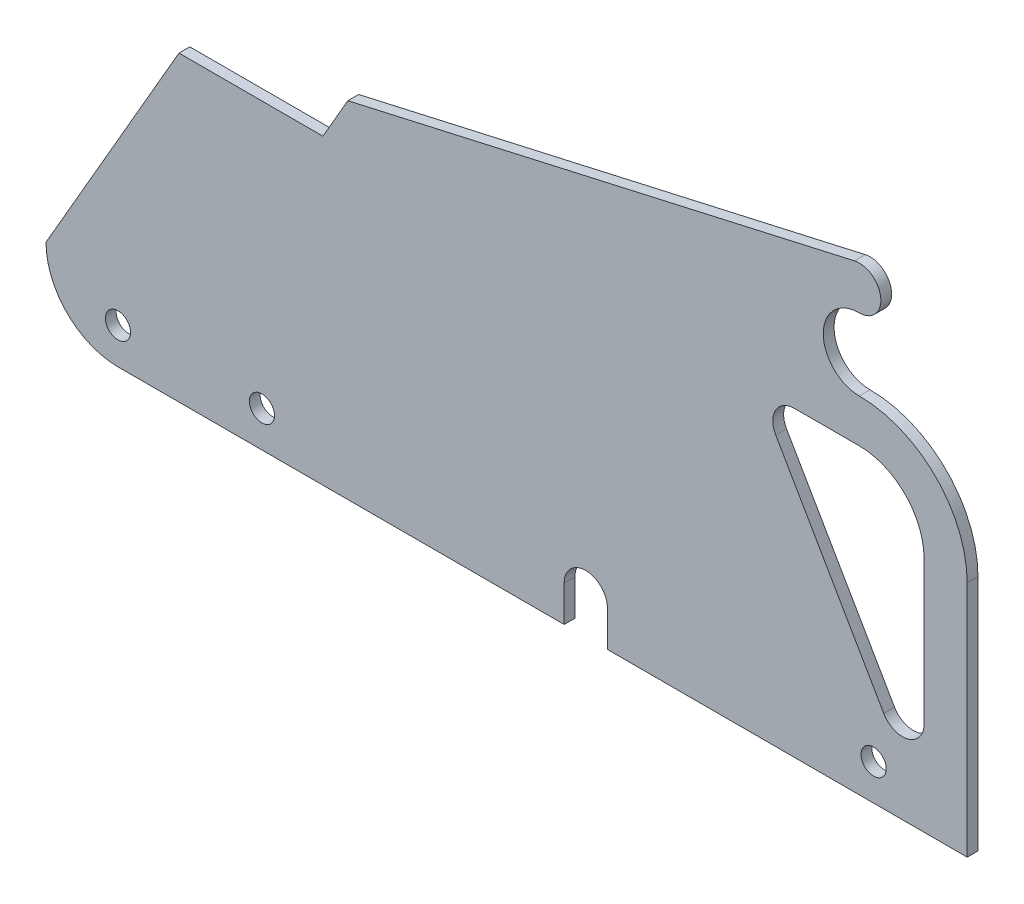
ISO-10303-21;
HEADER;
FILE_DESCRIPTION(('STEP AP214'),'2;1');
FILE_NAME('part.step','',(''),(''),'','','');
FILE_SCHEMA(('AUTOMOTIVE_DESIGN { 1 0 10303 214 1 1 1 1 }'));
ENDSEC;
DATA;
#1=APPLICATION_CONTEXT('core data for automotive mechanical design processes');
#2=APPLICATION_PROTOCOL_DEFINITION('international standard','automotive_design',2000,#1);
#3=PRODUCT_CONTEXT('',#1,'mechanical');
#4=PRODUCT('Part','Part','',(#3));
#5=PRODUCT_RELATED_PRODUCT_CATEGORY('part','',(#4));
#6=PRODUCT_DEFINITION_FORMATION('','',#4);
#7=PRODUCT_DEFINITION_CONTEXT('part definition',#1,'design');
#8=PRODUCT_DEFINITION('design','',#6,#7);
#9=PRODUCT_DEFINITION_SHAPE('','',#8);
#10=(LENGTH_UNIT() NAMED_UNIT(*) SI_UNIT(.MILLI.,.METRE.));
#11=(NAMED_UNIT(*) PLANE_ANGLE_UNIT() SI_UNIT($,.RADIAN.));
#12=(NAMED_UNIT(*) SI_UNIT($,.STERADIAN.) SOLID_ANGLE_UNIT());
#13=UNCERTAINTY_MEASURE_WITH_UNIT(LENGTH_MEASURE(1.E-05),#10,'distance_accuracy_value','');
#14=(GEOMETRIC_REPRESENTATION_CONTEXT(3) GLOBAL_UNCERTAINTY_ASSIGNED_CONTEXT((#13)) GLOBAL_UNIT_ASSIGNED_CONTEXT((#10,
#11,#12)) REPRESENTATION_CONTEXT('',''));
#15=CARTESIAN_POINT('',(0.,0.,0.));
#16=DIRECTION('',(0.,0.,1.));
#17=DIRECTION('',(1.,0.,0.));
#18=AXIS2_PLACEMENT_3D('',#15,#16,#17);
#19=CARTESIAN_POINT('',(-15.,33.,1.5));
#20=DIRECTION('',(0.,0.,1.));
#21=DIRECTION('',(1.,0.,0.));
#22=AXIS2_PLACEMENT_3D('',#19,#20,#21);
#23=PLANE('',#22);
#24=CARTESIAN_POINT('',(-98.,4.99999999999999,1.5));
#25=DIRECTION('',(0.,0.,1.));
#26=DIRECTION('',(1.,0.,0.));
#27=AXIS2_PLACEMENT_3D('',#24,#25,#26);
#28=CIRCLE('',#27,1.75);
#29=CARTESIAN_POINT('',(-96.25,4.99999999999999,1.5));
#30=VERTEX_POINT('',#29);
#31=EDGE_CURVE('E613',#30,#30,#28,.T.);
#32=ORIENTED_EDGE('',*,*,#31,.F.);
#33=EDGE_LOOP('',(#32));
#34=FACE_BOUND('',#33,.T.);
#35=DIRECTION('',(-1.,0.,0.));
#36=VECTOR('',#35,1.);
#37=CARTESIAN_POINT('',(-24.0111069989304,42.,1.5));
#38=LINE('',#37,#36);
#39=CARTESIAN_POINT('',(-15.,42.,1.5));
#40=VERTEX_POINT('',#39);
#41=CARTESIAN_POINT('',(-24.0111069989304,42.,1.5));
#42=VERTEX_POINT('',#41);
#43=EDGE_CURVE('E177',#40,#42,#38,.T.);
#44=ORIENTED_EDGE('',*,*,#43,.F.);
#45=CARTESIAN_POINT('',(-15.,33.,1.5));
#46=DIRECTION('',(0.,0.,1.));
#47=DIRECTION('',(1.,0.,0.));
#48=AXIS2_PLACEMENT_3D('',#45,#46,#47);
#49=CIRCLE('',#48,9.);
#50=CARTESIAN_POINT('',(-6.,33.,1.5));
#51=VERTEX_POINT('',#50);
#52=EDGE_CURVE('E169',#51,#40,#49,.T.);
#53=ORIENTED_EDGE('',*,*,#52,.F.);
#54=DIRECTION('',(0.,1.,0.));
#55=VECTOR('',#54,1.);
#56=CARTESIAN_POINT('',(-6.,33.,1.5));
#57=LINE('',#56,#55);
#58=CARTESIAN_POINT('',(-6.,13.,1.5));
#59=VERTEX_POINT('',#58);
#60=EDGE_CURVE('E200',#59,#51,#57,.T.);
#61=ORIENTED_EDGE('',*,*,#60,.F.);
#62=CARTESIAN_POINT('',(-9.,13.,1.5));
#63=DIRECTION('',(0.,0.,1.));
#64=DIRECTION('',(1.,0.,0.));
#65=AXIS2_PLACEMENT_3D('',#62,#63,#64);
#66=CIRCLE('',#65,3.);
#67=CARTESIAN_POINT('',(-11.5980762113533,11.5,1.5));
#68=VERTEX_POINT('',#67);
#69=EDGE_CURVE('E198',#68,#59,#66,.T.);
#70=ORIENTED_EDGE('',*,*,#69,.F.);
#71=DIRECTION('',(0.500000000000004,-0.866025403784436,0.));
#72=VECTOR('',#71,1.);
#73=CARTESIAN_POINT('',(-26.6091832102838,37.5,1.5));
#74=LINE('',#73,#72);
#75=CARTESIAN_POINT('',(-26.6091832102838,37.5,1.5));
#76=VERTEX_POINT('',#75);
#77=EDGE_CURVE('E193',#76,#68,#74,.T.);
#78=ORIENTED_EDGE('',*,*,#77,.F.);
#79=CARTESIAN_POINT('',(-24.0111069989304,39.,1.5));
#80=DIRECTION('',(0.,0.,1.));
#81=DIRECTION('',(1.,0.,0.));
#82=AXIS2_PLACEMENT_3D('',#79,#80,#81);
#83=CIRCLE('',#82,3.);
#84=EDGE_CURVE('E191',#42,#76,#83,.T.);
#85=ORIENTED_EDGE('',*,*,#84,.F.);
#86=EDGE_LOOP('',(#44,#53,#61,#70,#78,#85));
#87=FACE_BOUND('',#86,.T.);
#88=CARTESIAN_POINT('',(-15.,33.,1.5));
#89=DIRECTION('',(0.,0.,1.));
#90=DIRECTION('',(1.,0.,0.));
#91=AXIS2_PLACEMENT_3D('',#88,#89,#90);
#92=CIRCLE('',#91,15.);
#93=CARTESIAN_POINT('',(0.,33.,1.5));
#94=VERTEX_POINT('',#93);
#95=CARTESIAN_POINT('',(-15.,48.,1.5));
#96=VERTEX_POINT('',#95);
#97=EDGE_CURVE('E223',#94,#96,#92,.T.);
#98=ORIENTED_EDGE('',*,*,#97,.T.);
#99=CARTESIAN_POINT('',(-15.,53.,1.5));
#100=DIRECTION('',(0.,0.,-1.));
#101=DIRECTION('',(1.,0.,0.));
#102=AXIS2_PLACEMENT_3D('',#99,#100,#101);
#103=CIRCLE('',#102,5.);
#104=CARTESIAN_POINT('',(-15.,58.,1.5));
#105=VERTEX_POINT('',#104);
#106=EDGE_CURVE('E226',#96,#105,#103,.T.);
#107=ORIENTED_EDGE('',*,*,#106,.T.);
#108=CARTESIAN_POINT('',(-15.,61.,1.5));
#109=DIRECTION('',(0.,0.,1.));
#110=DIRECTION('',(1.,0.,0.));
#111=AXIS2_PLACEMENT_3D('',#108,#109,#110);
#112=CIRCLE('',#111,2.99999999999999);
#113=CARTESIAN_POINT('',(-15.661951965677,63.926058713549,1.5));
#114=VERTEX_POINT('',#113);
#115=EDGE_CURVE('E229',#105,#114,#112,.T.);
#116=ORIENTED_EDGE('',*,*,#115,.T.);
#117=DIRECTION('',(-0.975352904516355,-0.220650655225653,0.));
#118=VECTOR('',#117,1.);
#119=CARTESIAN_POINT('',(-15.661951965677,63.926058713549,1.5));
#120=LINE('',#119,#118);
#121=CARTESIAN_POINT('',(-86.0606897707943,48.,1.5));
#122=VERTEX_POINT('',#121);
#123=EDGE_CURVE('E231',#114,#122,#120,.T.);
#124=ORIENTED_EDGE('',*,*,#123,.T.);
#125=DIRECTION('',(-0.499999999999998,-0.866025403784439,0.));
#126=VECTOR('',#125,1.);
#127=CARTESIAN_POINT('',(-86.0606897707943,48.,1.5));
#128=LINE('',#127,#126);
#129=CARTESIAN_POINT('',(-89.5247913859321,42.,1.5));
#130=VERTEX_POINT('',#129);
#131=EDGE_CURVE('E233',#122,#130,#128,.T.);
#132=ORIENTED_EDGE('',*,*,#131,.T.);
#133=DIRECTION('',(-1.,0.,0.));
#134=VECTOR('',#133,1.);
#135=CARTESIAN_POINT('',(-89.5247913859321,42.,1.5));
#136=LINE('',#135,#134);
#137=CARTESIAN_POINT('',(-109.524791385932,42.,1.5));
#138=VERTEX_POINT('',#137);
#139=EDGE_CURVE('E235',#130,#138,#136,.T.);
#140=ORIENTED_EDGE('',*,*,#139,.T.);
#141=DIRECTION('',(-0.499999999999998,-0.86602540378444,0.));
#142=VECTOR('',#141,1.);
#143=CARTESIAN_POINT('',(-109.524791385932,42.,1.5));
#144=LINE('',#143,#142);
#145=CARTESIAN_POINT('',(-128.,10.,1.5));
#146=VERTEX_POINT('',#145);
#147=EDGE_CURVE('E237',#138,#146,#144,.T.);
#148=ORIENTED_EDGE('',*,*,#147,.T.);
#149=CARTESIAN_POINT('',(-118.,9.99999999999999,1.5));
#150=DIRECTION('',(0.,0.,1.));
#151=DIRECTION('',(1.,0.,0.));
#152=AXIS2_PLACEMENT_3D('',#149,#150,#151);
#153=CIRCLE('',#152,10.);
#154=CARTESIAN_POINT('',(-118.,0.,1.5));
#155=VERTEX_POINT('',#154);
#156=EDGE_CURVE('E239',#146,#155,#153,.T.);
#157=ORIENTED_EDGE('',*,*,#156,.T.);
#158=DIRECTION('',(1.,0.,0.));
#159=VECTOR('',#158,1.);
#160=CARTESIAN_POINT('',(-56.,0.,1.5));
#161=LINE('',#160,#159);
#162=CARTESIAN_POINT('',(-56.,0.,1.5));
#163=VERTEX_POINT('',#162);
#164=EDGE_CURVE('E241',#155,#163,#161,.T.);
#165=ORIENTED_EDGE('',*,*,#164,.T.);
#166=DIRECTION('',(0.,1.,0.));
#167=VECTOR('',#166,1.);
#168=CARTESIAN_POINT('',(-56.,4.99999999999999,1.5));
#169=LINE('',#168,#167);
#170=CARTESIAN_POINT('',(-56.,4.99999999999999,1.5));
#171=VERTEX_POINT('',#170);
#172=EDGE_CURVE('E243',#163,#171,#169,.T.);
#173=ORIENTED_EDGE('',*,*,#172,.T.);
#174=CARTESIAN_POINT('',(-53.,4.99999999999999,1.5));
#175=DIRECTION('',(0.,0.,-1.));
#176=DIRECTION('',(1.,0.,0.));
#177=AXIS2_PLACEMENT_3D('',#174,#175,#176);
#178=CIRCLE('',#177,3.);
#179=CARTESIAN_POINT('',(-50.,4.99999999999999,1.5));
#180=VERTEX_POINT('',#179);
#181=EDGE_CURVE('E245',#171,#180,#178,.T.);
#182=ORIENTED_EDGE('',*,*,#181,.T.);
#183=DIRECTION('',(0.,-1.,0.));
#184=VECTOR('',#183,1.);
#185=CARTESIAN_POINT('',(-50.,4.99999999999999,1.5));
#186=LINE('',#185,#184);
#187=CARTESIAN_POINT('',(-50.,0.,1.5));
#188=VERTEX_POINT('',#187);
#189=EDGE_CURVE('E247',#180,#188,#186,.T.);
#190=ORIENTED_EDGE('',*,*,#189,.T.);
#191=DIRECTION('',(1.,0.,0.));
#192=VECTOR('',#191,1.);
#193=CARTESIAN_POINT('',(0.,0.,1.5));
#194=LINE('',#193,#192);
#195=CARTESIAN_POINT('',(0.,0.,1.5));
#196=VERTEX_POINT('',#195);
#197=EDGE_CURVE('E249',#188,#196,#194,.T.);
#198=ORIENTED_EDGE('',*,*,#197,.T.);
#199=DIRECTION('',(0.,1.,0.));
#200=VECTOR('',#199,1.);
#201=CARTESIAN_POINT('',(0.,33.,1.5));
#202=LINE('',#201,#200);
#203=EDGE_CURVE('E251',#196,#94,#202,.T.);
#204=ORIENTED_EDGE('',*,*,#203,.T.);
#205=EDGE_LOOP('',(#98,#107,#116,#124,#132,#140,#148,#157,#165,#173,#182,#190,#198,#204));
#206=FACE_BOUND('',#205,.T.);
#207=CARTESIAN_POINT('',(-13.,4.99999999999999,1.5));
#208=DIRECTION('',(0.,0.,1.));
#209=DIRECTION('',(1.,0.,0.));
#210=AXIS2_PLACEMENT_3D('',#207,#208,#209);
#211=CIRCLE('',#210,1.75);
#212=CARTESIAN_POINT('',(-11.25,4.99999999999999,1.5));
#213=VERTEX_POINT('',#212);
#214=EDGE_CURVE('E203',#213,#213,#211,.T.);
#215=ORIENTED_EDGE('',*,*,#214,.F.);
#216=EDGE_LOOP('',(#215));
#217=FACE_BOUND('',#216,.T.);
#218=CARTESIAN_POINT('',(-118.,4.99999999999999,1.5));
#219=DIRECTION('',(0.,0.,1.));
#220=DIRECTION('',(1.,0.,0.));
#221=AXIS2_PLACEMENT_3D('',#218,#219,#220);
#222=CIRCLE('',#221,1.75);
#223=CARTESIAN_POINT('',(-116.25,4.99999999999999,1.5));
#224=VERTEX_POINT('',#223);
#225=EDGE_CURVE('E604',#224,#224,#222,.T.);
#226=ORIENTED_EDGE('',*,*,#225,.F.);
#227=EDGE_LOOP('',(#226));
#228=FACE_BOUND('',#227,.T.);
#229=ADVANCED_FACE('F32',(#34,#87,#206,#217,#228),#23,.T.);
#230=CARTESIAN_POINT('',(-15.,33.,0.));
#231=DIRECTION('',(0.,0.,1.));
#232=DIRECTION('',(1.,0.,0.));
#233=AXIS2_PLACEMENT_3D('',#230,#231,#232);
#234=PLANE('',#233);
#235=CARTESIAN_POINT('',(-98.,4.99999999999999,0.));
#236=DIRECTION('',(0.,0.,1.));
#237=DIRECTION('',(1.,0.,0.));
#238=AXIS2_PLACEMENT_3D('',#235,#236,#237);
#239=CIRCLE('',#238,1.75);
#240=CARTESIAN_POINT('',(-96.25,4.99999999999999,0.));
#241=VERTEX_POINT('',#240);
#242=EDGE_CURVE('E610',#241,#241,#239,.T.);
#243=ORIENTED_EDGE('',*,*,#242,.T.);
#244=EDGE_LOOP('',(#243));
#245=FACE_BOUND('',#244,.T.);
#246=CARTESIAN_POINT('',(-15.,33.,0.));
#247=DIRECTION('',(0.,0.,1.));
#248=DIRECTION('',(1.,0.,0.));
#249=AXIS2_PLACEMENT_3D('',#246,#247,#248);
#250=CIRCLE('',#249,9.);
#251=CARTESIAN_POINT('',(-6.,33.,0.));
#252=VERTEX_POINT('',#251);
#253=CARTESIAN_POINT('',(-15.,42.,0.));
#254=VERTEX_POINT('',#253);
#255=EDGE_CURVE('E55',#252,#254,#250,.T.);
#256=ORIENTED_EDGE('',*,*,#255,.T.);
#257=DIRECTION('',(-1.,0.,0.));
#258=VECTOR('',#257,1.);
#259=CARTESIAN_POINT('',(-24.0111069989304,42.,0.));
#260=LINE('',#259,#258);
#261=CARTESIAN_POINT('',(-24.0111069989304,42.,0.));
#262=VERTEX_POINT('',#261);
#263=EDGE_CURVE('E184',#254,#262,#260,.T.);
#264=ORIENTED_EDGE('',*,*,#263,.T.);
#265=CARTESIAN_POINT('',(-24.0111069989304,39.,0.));
#266=DIRECTION('',(0.,0.,1.));
#267=DIRECTION('',(1.,0.,0.));
#268=AXIS2_PLACEMENT_3D('',#265,#266,#267);
#269=CIRCLE('',#268,3.);
#270=CARTESIAN_POINT('',(-26.6091832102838,37.5,0.));
#271=VERTEX_POINT('',#270);
#272=EDGE_CURVE('E205',#262,#271,#269,.T.);
#273=ORIENTED_EDGE('',*,*,#272,.T.);
#274=DIRECTION('',(0.500000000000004,-0.866025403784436,0.));
#275=VECTOR('',#274,1.);
#276=CARTESIAN_POINT('',(-26.6091832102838,37.5,0.));
#277=LINE('',#276,#275);
#278=CARTESIAN_POINT('',(-11.5980762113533,11.5,0.));
#279=VERTEX_POINT('',#278);
#280=EDGE_CURVE('E208',#271,#279,#277,.T.);
#281=ORIENTED_EDGE('',*,*,#280,.T.);
#282=CARTESIAN_POINT('',(-9.,13.,0.));
#283=DIRECTION('',(0.,0.,1.));
#284=DIRECTION('',(1.,0.,0.));
#285=AXIS2_PLACEMENT_3D('',#282,#283,#284);
#286=CIRCLE('',#285,3.);
#287=CARTESIAN_POINT('',(-6.,13.,0.));
#288=VERTEX_POINT('',#287);
#289=EDGE_CURVE('E211',#279,#288,#286,.T.);
#290=ORIENTED_EDGE('',*,*,#289,.T.);
#291=DIRECTION('',(0.,1.,0.));
#292=VECTOR('',#291,1.);
#293=CARTESIAN_POINT('',(-6.,33.,0.));
#294=LINE('',#293,#292);
#295=EDGE_CURVE('E178',#288,#252,#294,.T.);
#296=ORIENTED_EDGE('',*,*,#295,.T.);
#297=EDGE_LOOP('',(#256,#264,#273,#281,#290,#296));
#298=FACE_BOUND('',#297,.T.);
#299=CARTESIAN_POINT('',(-15.,33.,0.));
#300=DIRECTION('',(0.,0.,1.));
#301=DIRECTION('',(1.,0.,0.));
#302=AXIS2_PLACEMENT_3D('',#299,#300,#301);
#303=CIRCLE('',#302,15.);
#304=CARTESIAN_POINT('',(0.,33.,0.));
#305=VERTEX_POINT('',#304);
#306=CARTESIAN_POINT('',(-15.,48.,0.));
#307=VERTEX_POINT('',#306);
#308=EDGE_CURVE('E185',#305,#307,#303,.T.);
#309=ORIENTED_EDGE('',*,*,#308,.F.);
#310=DIRECTION('',(0.,1.,0.));
#311=VECTOR('',#310,1.);
#312=CARTESIAN_POINT('',(0.,33.,0.));
#313=LINE('',#312,#311);
#314=CARTESIAN_POINT('',(0.,0.,0.));
#315=VERTEX_POINT('',#314);
#316=EDGE_CURVE('E227',#315,#305,#313,.T.);
#317=ORIENTED_EDGE('',*,*,#316,.F.);
#318=DIRECTION('',(1.,0.,0.));
#319=VECTOR('',#318,1.);
#320=CARTESIAN_POINT('',(0.,0.,0.));
#321=LINE('',#320,#319);
#322=CARTESIAN_POINT('',(-50.,0.,0.));
#323=VERTEX_POINT('',#322);
#324=EDGE_CURVE('E278',#323,#315,#321,.T.);
#325=ORIENTED_EDGE('',*,*,#324,.F.);
#326=DIRECTION('',(0.,-1.,0.));
#327=VECTOR('',#326,1.);
#328=CARTESIAN_POINT('',(-50.,4.99999999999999,0.));
#329=LINE('',#328,#327);
#330=CARTESIAN_POINT('',(-50.,4.99999999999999,0.));
#331=VERTEX_POINT('',#330);
#332=EDGE_CURVE('E276',#331,#323,#329,.T.);
#333=ORIENTED_EDGE('',*,*,#332,.F.);
#334=CARTESIAN_POINT('',(-53.,4.99999999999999,0.));
#335=DIRECTION('',(0.,0.,-1.));
#336=DIRECTION('',(1.,0.,0.));
#337=AXIS2_PLACEMENT_3D('',#334,#335,#336);
#338=CIRCLE('',#337,3.);
#339=CARTESIAN_POINT('',(-56.,4.99999999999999,0.));
#340=VERTEX_POINT('',#339);
#341=EDGE_CURVE('E274',#340,#331,#338,.T.);
#342=ORIENTED_EDGE('',*,*,#341,.F.);
#343=DIRECTION('',(0.,1.,0.));
#344=VECTOR('',#343,1.);
#345=CARTESIAN_POINT('',(-56.,4.99999999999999,0.));
#346=LINE('',#345,#344);
#347=CARTESIAN_POINT('',(-56.,0.,0.));
#348=VERTEX_POINT('',#347);
#349=EDGE_CURVE('E272',#348,#340,#346,.T.);
#350=ORIENTED_EDGE('',*,*,#349,.F.);
#351=DIRECTION('',(1.,0.,0.));
#352=VECTOR('',#351,1.);
#353=CARTESIAN_POINT('',(-56.,0.,0.));
#354=LINE('',#353,#352);
#355=CARTESIAN_POINT('',(-118.,0.,0.));
#356=VERTEX_POINT('',#355);
#357=EDGE_CURVE('E270',#356,#348,#354,.T.);
#358=ORIENTED_EDGE('',*,*,#357,.F.);
#359=CARTESIAN_POINT('',(-118.,9.99999999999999,0.));
#360=DIRECTION('',(0.,0.,1.));
#361=DIRECTION('',(1.,0.,0.));
#362=AXIS2_PLACEMENT_3D('',#359,#360,#361);
#363=CIRCLE('',#362,10.);
#364=CARTESIAN_POINT('',(-128.,10.,0.));
#365=VERTEX_POINT('',#364);
#366=EDGE_CURVE('E268',#365,#356,#363,.T.);
#367=ORIENTED_EDGE('',*,*,#366,.F.);
#368=DIRECTION('',(-0.499999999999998,-0.86602540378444,0.));
#369=VECTOR('',#368,1.);
#370=CARTESIAN_POINT('',(-109.524791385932,42.,0.));
#371=LINE('',#370,#369);
#372=CARTESIAN_POINT('',(-109.524791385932,42.,0.));
#373=VERTEX_POINT('',#372);
#374=EDGE_CURVE('E266',#373,#365,#371,.T.);
#375=ORIENTED_EDGE('',*,*,#374,.F.);
#376=DIRECTION('',(-1.,0.,0.));
#377=VECTOR('',#376,1.);
#378=CARTESIAN_POINT('',(-89.5247913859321,42.,0.));
#379=LINE('',#378,#377);
#380=CARTESIAN_POINT('',(-89.5247913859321,42.,0.));
#381=VERTEX_POINT('',#380);
#382=EDGE_CURVE('E264',#381,#373,#379,.T.);
#383=ORIENTED_EDGE('',*,*,#382,.F.);
#384=DIRECTION('',(-0.499999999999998,-0.866025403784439,0.));
#385=VECTOR('',#384,1.);
#386=CARTESIAN_POINT('',(-86.0606897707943,48.,0.));
#387=LINE('',#386,#385);
#388=CARTESIAN_POINT('',(-86.0606897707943,48.,0.));
#389=VERTEX_POINT('',#388);
#390=EDGE_CURVE('E262',#389,#381,#387,.T.);
#391=ORIENTED_EDGE('',*,*,#390,.F.);
#392=DIRECTION('',(-0.975352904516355,-0.220650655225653,0.));
#393=VECTOR('',#392,1.);
#394=CARTESIAN_POINT('',(-15.661951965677,63.926058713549,0.));
#395=LINE('',#394,#393);
#396=CARTESIAN_POINT('',(-15.661951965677,63.926058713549,0.));
#397=VERTEX_POINT('',#396);
#398=EDGE_CURVE('E260',#397,#389,#395,.T.);
#399=ORIENTED_EDGE('',*,*,#398,.F.);
#400=CARTESIAN_POINT('',(-15.,61.,0.));
#401=DIRECTION('',(0.,0.,1.));
#402=DIRECTION('',(1.,0.,0.));
#403=AXIS2_PLACEMENT_3D('',#400,#401,#402);
#404=CIRCLE('',#403,2.99999999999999);
#405=CARTESIAN_POINT('',(-15.,58.,0.));
#406=VERTEX_POINT('',#405);
#407=EDGE_CURVE('E258',#406,#397,#404,.T.);
#408=ORIENTED_EDGE('',*,*,#407,.F.);
#409=CARTESIAN_POINT('',(-15.,53.,0.));
#410=DIRECTION('',(0.,0.,-1.));
#411=DIRECTION('',(1.,0.,0.));
#412=AXIS2_PLACEMENT_3D('',#409,#410,#411);
#413=CIRCLE('',#412,5.);
#414=EDGE_CURVE('E256',#307,#406,#413,.T.);
#415=ORIENTED_EDGE('',*,*,#414,.F.);
#416=EDGE_LOOP('',(#309,#317,#325,#333,#342,#350,#358,#367,#375,#383,#391,#399,#408,#415));
#417=FACE_BOUND('',#416,.T.);
#418=CARTESIAN_POINT('',(-13.,4.99999999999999,0.));
#419=DIRECTION('',(0.,0.,1.));
#420=DIRECTION('',(1.,0.,0.));
#421=AXIS2_PLACEMENT_3D('',#418,#419,#420);
#422=CIRCLE('',#421,1.75);
#423=CARTESIAN_POINT('',(-11.25,4.99999999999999,0.));
#424=VERTEX_POINT('',#423);
#425=EDGE_CURVE('E616',#424,#424,#422,.T.);
#426=ORIENTED_EDGE('',*,*,#425,.T.);
#427=EDGE_LOOP('',(#426));
#428=FACE_BOUND('',#427,.T.);
#429=CARTESIAN_POINT('',(-118.,4.99999999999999,0.));
#430=DIRECTION('',(0.,0.,1.));
#431=DIRECTION('',(1.,0.,0.));
#432=AXIS2_PLACEMENT_3D('',#429,#430,#431);
#433=CIRCLE('',#432,1.75);
#434=CARTESIAN_POINT('',(-116.25,4.99999999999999,0.));
#435=VERTEX_POINT('',#434);
#436=EDGE_CURVE('E607',#435,#435,#433,.T.);
#437=ORIENTED_EDGE('',*,*,#436,.T.);
#438=EDGE_LOOP('',(#437));
#439=FACE_BOUND('',#438,.T.);
#440=ADVANCED_FACE('F326',(#245,#298,#417,#428,#439),#234,.F.);
#441=CARTESIAN_POINT('',(-15.,33.,1.5));
#442=DIRECTION('',(0.,0.,-1.));
#443=DIRECTION('',(-1.,0.,0.));
#444=AXIS2_PLACEMENT_3D('',#441,#442,#443);
#445=CYLINDRICAL_SURFACE('',#444,15.);
#446=ORIENTED_EDGE('',*,*,#308,.T.);
#447=DIRECTION('',(0.,0.,-1.));
#448=VECTOR('',#447,1.);
#449=CARTESIAN_POINT('',(-15.,48.,1.5));
#450=LINE('',#449,#448);
#451=EDGE_CURVE('E11',#96,#307,#450,.T.);
#452=ORIENTED_EDGE('',*,*,#451,.F.);
#453=ORIENTED_EDGE('',*,*,#97,.F.);
#454=DIRECTION('',(0.,0.,-1.));
#455=VECTOR('',#454,1.);
#456=CARTESIAN_POINT('',(0.,33.,1.5));
#457=LINE('',#456,#455);
#458=EDGE_CURVE('E253',#94,#305,#457,.T.);
#459=ORIENTED_EDGE('',*,*,#458,.T.);
#460=EDGE_LOOP('',(#446,#452,#453,#459));
#461=FACE_BOUND('',#460,.T.);
#462=ADVANCED_FACE('F34',(#461),#445,.T.);
#463=CARTESIAN_POINT('',(-15.,53.,1.5));
#464=DIRECTION('',(0.,0.,-1.));
#465=DIRECTION('',(-1.,0.,0.));
#466=AXIS2_PLACEMENT_3D('',#463,#464,#465);
#467=CYLINDRICAL_SURFACE('',#466,5.);
#468=ORIENTED_EDGE('',*,*,#414,.T.);
#469=DIRECTION('',(0.,0.,-1.));
#470=VECTOR('',#469,1.);
#471=CARTESIAN_POINT('',(-15.,58.,1.5));
#472=LINE('',#471,#470);
#473=EDGE_CURVE('E40',#105,#406,#472,.T.);
#474=ORIENTED_EDGE('',*,*,#473,.F.);
#475=ORIENTED_EDGE('',*,*,#106,.F.);
#476=ORIENTED_EDGE('',*,*,#451,.T.);
#477=EDGE_LOOP('',(#468,#474,#475,#476));
#478=FACE_BOUND('',#477,.T.);
#479=ADVANCED_FACE('F343',(#478),#467,.F.);
#480=CARTESIAN_POINT('',(-15.,61.,1.5));
#481=DIRECTION('',(0.,0.,-1.));
#482=DIRECTION('',(-1.,0.,0.));
#483=AXIS2_PLACEMENT_3D('',#480,#481,#482);
#484=CYLINDRICAL_SURFACE('',#483,2.99999999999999);
#485=ORIENTED_EDGE('',*,*,#407,.T.);
#486=DIRECTION('',(0.,0.,-1.));
#487=VECTOR('',#486,1.);
#488=CARTESIAN_POINT('',(-15.661951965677,63.926058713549,1.5));
#489=LINE('',#488,#487);
#490=EDGE_CURVE('E313',#114,#397,#489,.T.);
#491=ORIENTED_EDGE('',*,*,#490,.F.);
#492=ORIENTED_EDGE('',*,*,#115,.F.);
#493=ORIENTED_EDGE('',*,*,#473,.T.);
#494=EDGE_LOOP('',(#485,#491,#492,#493));
#495=FACE_BOUND('',#494,.T.);
#496=ADVANCED_FACE('F320',(#495),#484,.T.);
#497=CARTESIAN_POINT('',(-15.661951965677,63.926058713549,1.5));
#498=DIRECTION('',(0.220650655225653,-0.975352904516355,0.));
#499=DIRECTION('',(0.975352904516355,0.220650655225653,0.));
#500=AXIS2_PLACEMENT_3D('',#497,#498,#499);
#501=PLANE('',#500);
#502=ORIENTED_EDGE('',*,*,#398,.T.);
#503=DIRECTION('',(0.,0.,-1.));
#504=VECTOR('',#503,1.);
#505=CARTESIAN_POINT('',(-86.0606897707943,48.,1.5));
#506=LINE('',#505,#504);
#507=EDGE_CURVE('E310',#122,#389,#506,.T.);
#508=ORIENTED_EDGE('',*,*,#507,.F.);
#509=ORIENTED_EDGE('',*,*,#123,.F.);
#510=ORIENTED_EDGE('',*,*,#490,.T.);
#511=EDGE_LOOP('',(#502,#508,#509,#510));
#512=FACE_BOUND('',#511,.T.);
#513=ADVANCED_FACE('F332',(#512),#501,.F.);
#514=CARTESIAN_POINT('',(-86.0606897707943,48.,1.5));
#515=DIRECTION('',(0.86602540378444,-0.499999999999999,0.));
#516=DIRECTION('',(0.499999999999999,0.86602540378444,0.));
#517=AXIS2_PLACEMENT_3D('',#514,#515,#516);
#518=PLANE('',#517);
#519=ORIENTED_EDGE('',*,*,#390,.T.);
#520=DIRECTION('',(0.,0.,-1.));
#521=VECTOR('',#520,1.);
#522=CARTESIAN_POINT('',(-89.5247913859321,42.,1.5));
#523=LINE('',#522,#521);
#524=EDGE_CURVE('E307',#130,#381,#523,.T.);
#525=ORIENTED_EDGE('',*,*,#524,.F.);
#526=ORIENTED_EDGE('',*,*,#131,.F.);
#527=ORIENTED_EDGE('',*,*,#507,.T.);
#528=EDGE_LOOP('',(#519,#525,#526,#527));
#529=FACE_BOUND('',#528,.T.);
#530=ADVANCED_FACE('F336',(#529),#518,.F.);
#531=CARTESIAN_POINT('',(-89.5247913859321,42.,1.5));
#532=DIRECTION('',(0.,-1.,0.));
#533=DIRECTION('',(0.,0.,-1.));
#534=AXIS2_PLACEMENT_3D('',#531,#532,#533);
#535=PLANE('',#534);
#536=ORIENTED_EDGE('',*,*,#382,.T.);
#537=DIRECTION('',(0.,0.,-1.));
#538=VECTOR('',#537,1.);
#539=CARTESIAN_POINT('',(-109.524791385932,42.,1.5));
#540=LINE('',#539,#538);
#541=EDGE_CURVE('E304',#138,#373,#540,.T.);
#542=ORIENTED_EDGE('',*,*,#541,.F.);
#543=ORIENTED_EDGE('',*,*,#139,.F.);
#544=ORIENTED_EDGE('',*,*,#524,.T.);
#545=EDGE_LOOP('',(#536,#542,#543,#544));
#546=FACE_BOUND('',#545,.T.);
#547=ADVANCED_FACE('F386',(#546),#535,.F.);
#548=CARTESIAN_POINT('',(-109.524791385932,42.,1.5));
#549=DIRECTION('',(0.86602540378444,-0.499999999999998,0.));
#550=DIRECTION('',(0.499999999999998,0.86602540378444,0.));
#551=AXIS2_PLACEMENT_3D('',#548,#549,#550);
#552=PLANE('',#551);
#553=ORIENTED_EDGE('',*,*,#374,.T.);
#554=DIRECTION('',(0.,0.,-1.));
#555=VECTOR('',#554,1.);
#556=CARTESIAN_POINT('',(-128.,10.,1.5));
#557=LINE('',#556,#555);
#558=EDGE_CURVE('E301',#146,#365,#557,.T.);
#559=ORIENTED_EDGE('',*,*,#558,.F.);
#560=ORIENTED_EDGE('',*,*,#147,.F.);
#561=ORIENTED_EDGE('',*,*,#541,.T.);
#562=EDGE_LOOP('',(#553,#559,#560,#561));
#563=FACE_BOUND('',#562,.T.);
#564=ADVANCED_FACE('F384',(#563),#552,.F.);
#565=CARTESIAN_POINT('',(-118.,9.99999999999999,1.5));
#566=DIRECTION('',(0.,0.,-1.));
#567=DIRECTION('',(-1.,0.,0.));
#568=AXIS2_PLACEMENT_3D('',#565,#566,#567);
#569=CYLINDRICAL_SURFACE('',#568,10.);
#570=ORIENTED_EDGE('',*,*,#366,.T.);
#571=DIRECTION('',(0.,0.,-1.));
#572=VECTOR('',#571,1.);
#573=CARTESIAN_POINT('',(-118.,0.,1.5));
#574=LINE('',#573,#572);
#575=EDGE_CURVE('E298',#155,#356,#574,.T.);
#576=ORIENTED_EDGE('',*,*,#575,.F.);
#577=ORIENTED_EDGE('',*,*,#156,.F.);
#578=ORIENTED_EDGE('',*,*,#558,.T.);
#579=EDGE_LOOP('',(#570,#576,#577,#578));
#580=FACE_BOUND('',#579,.T.);
#581=ADVANCED_FACE('F379',(#580),#569,.T.);
#582=CARTESIAN_POINT('',(-56.,0.,1.5));
#583=DIRECTION('',(0.,1.,0.));
#584=DIRECTION('',(-1.,0.,0.));
#585=AXIS2_PLACEMENT_3D('',#582,#583,#584);
#586=PLANE('',#585);
#587=ORIENTED_EDGE('',*,*,#357,.T.);
#588=DIRECTION('',(0.,0.,-1.));
#589=VECTOR('',#588,1.);
#590=CARTESIAN_POINT('',(-56.,0.,1.5));
#591=LINE('',#590,#589);
#592=EDGE_CURVE('E295',#163,#348,#591,.T.);
#593=ORIENTED_EDGE('',*,*,#592,.F.);
#594=ORIENTED_EDGE('',*,*,#164,.F.);
#595=ORIENTED_EDGE('',*,*,#575,.T.);
#596=EDGE_LOOP('',(#587,#593,#594,#595));
#597=FACE_BOUND('',#596,.T.);
#598=ADVANCED_FACE('F374',(#597),#586,.F.);
#599=CARTESIAN_POINT('',(-56.,4.99999999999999,1.5));
#600=DIRECTION('',(-1.,0.,0.));
#601=DIRECTION('',(0.,0.,1.));
#602=AXIS2_PLACEMENT_3D('',#599,#600,#601);
#603=PLANE('',#602);
#604=ORIENTED_EDGE('',*,*,#349,.T.);
#605=DIRECTION('',(0.,0.,-1.));
#606=VECTOR('',#605,1.);
#607=CARTESIAN_POINT('',(-56.,4.99999999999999,1.5));
#608=LINE('',#607,#606);
#609=EDGE_CURVE('E292',#171,#340,#608,.T.);
#610=ORIENTED_EDGE('',*,*,#609,.F.);
#611=ORIENTED_EDGE('',*,*,#172,.F.);
#612=ORIENTED_EDGE('',*,*,#592,.T.);
#613=EDGE_LOOP('',(#604,#610,#611,#612));
#614=FACE_BOUND('',#613,.T.);
#615=ADVANCED_FACE('F370',(#614),#603,.F.);
#616=CARTESIAN_POINT('',(-53.,4.99999999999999,1.5));
#617=DIRECTION('',(0.,0.,-1.));
#618=DIRECTION('',(-1.,0.,0.));
#619=AXIS2_PLACEMENT_3D('',#616,#617,#618);
#620=CYLINDRICAL_SURFACE('',#619,3.);
#621=ORIENTED_EDGE('',*,*,#341,.T.);
#622=DIRECTION('',(0.,0.,-1.));
#623=VECTOR('',#622,1.);
#624=CARTESIAN_POINT('',(-50.,4.99999999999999,1.5));
#625=LINE('',#624,#623);
#626=EDGE_CURVE('E289',#180,#331,#625,.T.);
#627=ORIENTED_EDGE('',*,*,#626,.F.);
#628=ORIENTED_EDGE('',*,*,#181,.F.);
#629=ORIENTED_EDGE('',*,*,#609,.T.);
#630=EDGE_LOOP('',(#621,#627,#628,#629));
#631=FACE_BOUND('',#630,.T.);
#632=ADVANCED_FACE('F365',(#631),#620,.F.);
#633=CARTESIAN_POINT('',(-50.,4.99999999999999,1.5));
#634=DIRECTION('',(1.,0.,0.));
#635=DIRECTION('',(0.,0.,-1.));
#636=AXIS2_PLACEMENT_3D('',#633,#634,#635);
#637=PLANE('',#636);
#638=ORIENTED_EDGE('',*,*,#332,.T.);
#639=DIRECTION('',(0.,0.,-1.));
#640=VECTOR('',#639,1.);
#641=CARTESIAN_POINT('',(-50.,0.,1.5));
#642=LINE('',#641,#640);
#643=EDGE_CURVE('E286',#188,#323,#642,.T.);
#644=ORIENTED_EDGE('',*,*,#643,.F.);
#645=ORIENTED_EDGE('',*,*,#189,.F.);
#646=ORIENTED_EDGE('',*,*,#626,.T.);
#647=EDGE_LOOP('',(#638,#644,#645,#646));
#648=FACE_BOUND('',#647,.T.);
#649=ADVANCED_FACE('F359',(#648),#637,.F.);
#650=CARTESIAN_POINT('',(0.,0.,1.5));
#651=DIRECTION('',(0.,1.,0.));
#652=DIRECTION('',(-1.,0.,0.));
#653=AXIS2_PLACEMENT_3D('',#650,#651,#652);
#654=PLANE('',#653);
#655=ORIENTED_EDGE('',*,*,#324,.T.);
#656=DIRECTION('',(0.,0.,-1.));
#657=VECTOR('',#656,1.);
#658=CARTESIAN_POINT('',(0.,0.,1.5));
#659=LINE('',#658,#657);
#660=EDGE_CURVE('E283',#196,#315,#659,.T.);
#661=ORIENTED_EDGE('',*,*,#660,.F.);
#662=ORIENTED_EDGE('',*,*,#197,.F.);
#663=ORIENTED_EDGE('',*,*,#643,.T.);
#664=EDGE_LOOP('',(#655,#661,#662,#663));
#665=FACE_BOUND('',#664,.T.);
#666=ADVANCED_FACE('F355',(#665),#654,.F.);
#667=CARTESIAN_POINT('',(0.,33.,1.5));
#668=DIRECTION('',(-1.,0.,0.));
#669=DIRECTION('',(0.,-1.,0.));
#670=AXIS2_PLACEMENT_3D('',#667,#668,#669);
#671=PLANE('',#670);
#672=ORIENTED_EDGE('',*,*,#316,.T.);
#673=ORIENTED_EDGE('',*,*,#458,.F.);
#674=ORIENTED_EDGE('',*,*,#203,.F.);
#675=ORIENTED_EDGE('',*,*,#660,.T.);
#676=EDGE_LOOP('',(#672,#673,#674,#675));
#677=FACE_BOUND('',#676,.T.);
#678=ADVANCED_FACE('F350',(#677),#671,.F.);
#679=CARTESIAN_POINT('',(-15.,33.,1.5));
#680=DIRECTION('',(0.,0.,-1.));
#681=DIRECTION('',(-1.,0.,0.));
#682=AXIS2_PLACEMENT_3D('',#679,#680,#681);
#683=CYLINDRICAL_SURFACE('',#682,9.);
#684=ORIENTED_EDGE('',*,*,#255,.F.);
#685=DIRECTION('',(0.,0.,-1.));
#686=VECTOR('',#685,1.);
#687=CARTESIAN_POINT('',(-6.,33.,1.5));
#688=LINE('',#687,#686);
#689=EDGE_CURVE('E173',#51,#252,#688,.T.);
#690=ORIENTED_EDGE('',*,*,#689,.F.);
#691=ORIENTED_EDGE('',*,*,#52,.T.);
#692=DIRECTION('',(0.,0.,-1.));
#693=VECTOR('',#692,1.);
#694=CARTESIAN_POINT('',(-15.,42.,1.5));
#695=LINE('',#694,#693);
#696=EDGE_CURVE('E172',#40,#254,#695,.T.);
#697=ORIENTED_EDGE('',*,*,#696,.T.);
#698=EDGE_LOOP('',(#684,#690,#691,#697));
#699=FACE_BOUND('',#698,.T.);
#700=ADVANCED_FACE('F171',(#699),#683,.F.);
#701=CARTESIAN_POINT('',(-24.0111069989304,42.,1.5));
#702=DIRECTION('',(0.,-1.,0.));
#703=DIRECTION('',(0.,0.,-1.));
#704=AXIS2_PLACEMENT_3D('',#701,#702,#703);
#705=PLANE('',#704);
#706=ORIENTED_EDGE('',*,*,#263,.F.);
#707=ORIENTED_EDGE('',*,*,#696,.F.);
#708=ORIENTED_EDGE('',*,*,#43,.T.);
#709=DIRECTION('',(0.,0.,-1.));
#710=VECTOR('',#709,1.);
#711=CARTESIAN_POINT('',(-24.0111069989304,42.,1.5));
#712=LINE('',#711,#710);
#713=EDGE_CURVE('E186',#42,#262,#712,.T.);
#714=ORIENTED_EDGE('',*,*,#713,.T.);
#715=EDGE_LOOP('',(#706,#707,#708,#714));
#716=FACE_BOUND('',#715,.T.);
#717=ADVANCED_FACE('F181',(#716),#705,.T.);
#718=CARTESIAN_POINT('',(-24.0111069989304,39.,1.5));
#719=DIRECTION('',(0.,0.,-1.));
#720=DIRECTION('',(-1.,0.,0.));
#721=AXIS2_PLACEMENT_3D('',#718,#719,#720);
#722=CYLINDRICAL_SURFACE('',#721,3.);
#723=ORIENTED_EDGE('',*,*,#272,.F.);
#724=ORIENTED_EDGE('',*,*,#713,.F.);
#725=ORIENTED_EDGE('',*,*,#84,.T.);
#726=DIRECTION('',(0.,0.,-1.));
#727=VECTOR('',#726,1.);
#728=CARTESIAN_POINT('',(-26.6091832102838,37.5,1.5));
#729=LINE('',#728,#727);
#730=EDGE_CURVE('E220',#76,#271,#729,.T.);
#731=ORIENTED_EDGE('',*,*,#730,.T.);
#732=EDGE_LOOP('',(#723,#724,#725,#731));
#733=FACE_BOUND('',#732,.T.);
#734=ADVANCED_FACE('F459',(#733),#722,.F.);
#735=CARTESIAN_POINT('',(-26.6091832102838,37.5,1.5));
#736=DIRECTION('',(0.866025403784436,0.500000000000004,0.));
#737=DIRECTION('',(-0.500000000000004,0.866025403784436,0.));
#738=AXIS2_PLACEMENT_3D('',#735,#736,#737);
#739=PLANE('',#738);
#740=ORIENTED_EDGE('',*,*,#280,.F.);
#741=ORIENTED_EDGE('',*,*,#730,.F.);
#742=ORIENTED_EDGE('',*,*,#77,.T.);
#743=DIRECTION('',(0.,0.,-1.));
#744=VECTOR('',#743,1.);
#745=CARTESIAN_POINT('',(-11.5980762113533,11.5,1.5));
#746=LINE('',#745,#744);
#747=EDGE_CURVE('E218',#68,#279,#746,.T.);
#748=ORIENTED_EDGE('',*,*,#747,.T.);
#749=EDGE_LOOP('',(#740,#741,#742,#748));
#750=FACE_BOUND('',#749,.T.);
#751=ADVANCED_FACE('F465',(#750),#739,.T.);
#752=CARTESIAN_POINT('',(-9.,13.,1.5));
#753=DIRECTION('',(0.,0.,-1.));
#754=DIRECTION('',(-1.,0.,0.));
#755=AXIS2_PLACEMENT_3D('',#752,#753,#754);
#756=CYLINDRICAL_SURFACE('',#755,3.);
#757=ORIENTED_EDGE('',*,*,#289,.F.);
#758=ORIENTED_EDGE('',*,*,#747,.F.);
#759=ORIENTED_EDGE('',*,*,#69,.T.);
#760=DIRECTION('',(0.,0.,-1.));
#761=VECTOR('',#760,1.);
#762=CARTESIAN_POINT('',(-6.,13.,1.5));
#763=LINE('',#762,#761);
#764=EDGE_CURVE('E47',#59,#288,#763,.T.);
#765=ORIENTED_EDGE('',*,*,#764,.T.);
#766=EDGE_LOOP('',(#757,#758,#759,#765));
#767=FACE_BOUND('',#766,.T.);
#768=ADVANCED_FACE('F473',(#767),#756,.F.);
#769=CARTESIAN_POINT('',(-6.,33.,1.5));
#770=DIRECTION('',(-1.,0.,0.));
#771=DIRECTION('',(0.,-1.,0.));
#772=AXIS2_PLACEMENT_3D('',#769,#770,#771);
#773=PLANE('',#772);
#774=ORIENTED_EDGE('',*,*,#295,.F.);
#775=ORIENTED_EDGE('',*,*,#764,.F.);
#776=ORIENTED_EDGE('',*,*,#60,.T.);
#777=ORIENTED_EDGE('',*,*,#689,.T.);
#778=EDGE_LOOP('',(#774,#775,#776,#777));
#779=FACE_BOUND('',#778,.T.);
#780=ADVANCED_FACE('F481',(#779),#773,.T.);
#781=CARTESIAN_POINT('',(-13.,4.99999999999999,1.5));
#782=DIRECTION('',(0.,0.,-1.));
#783=DIRECTION('',(-1.,0.,0.));
#784=AXIS2_PLACEMENT_3D('',#781,#782,#783);
#785=CYLINDRICAL_SURFACE('',#784,1.75);
#786=ORIENTED_EDGE('',*,*,#214,.T.);
#787=EDGE_LOOP('',(#786));
#788=FACE_BOUND('',#787,.T.);
#789=ORIENTED_EDGE('',*,*,#425,.F.);
#790=EDGE_LOOP('',(#789));
#791=FACE_BOUND('',#790,.T.);
#792=ADVANCED_FACE('F489',(#788,#791),#785,.F.);
#793=CARTESIAN_POINT('',(-98.,4.99999999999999,1.5));
#794=DIRECTION('',(0.,0.,-1.));
#795=DIRECTION('',(-1.,0.,0.));
#796=AXIS2_PLACEMENT_3D('',#793,#794,#795);
#797=CYLINDRICAL_SURFACE('',#796,1.75);
#798=ORIENTED_EDGE('',*,*,#31,.T.);
#799=EDGE_LOOP('',(#798));
#800=FACE_BOUND('',#799,.T.);
#801=ORIENTED_EDGE('',*,*,#242,.F.);
#802=EDGE_LOOP('',(#801));
#803=FACE_BOUND('',#802,.T.);
#804=ADVANCED_FACE('F496',(#800,#803),#797,.F.);
#805=CARTESIAN_POINT('',(-118.,4.99999999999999,1.5));
#806=DIRECTION('',(0.,0.,-1.));
#807=DIRECTION('',(-1.,0.,0.));
#808=AXIS2_PLACEMENT_3D('',#805,#806,#807);
#809=CYLINDRICAL_SURFACE('',#808,1.75);
#810=ORIENTED_EDGE('',*,*,#225,.T.);
#811=EDGE_LOOP('',(#810));
#812=FACE_BOUND('',#811,.T.);
#813=ORIENTED_EDGE('',*,*,#436,.F.);
#814=EDGE_LOOP('',(#813));
#815=FACE_BOUND('',#814,.T.);
#816=ADVANCED_FACE('F504',(#812,#815),#809,.F.);
#817=CLOSED_SHELL('',(#229,#440,#462,#479,#496,#513,#530,#547,#564,#581,#598,#615,#632,#649,
#666,#678,#700,#717,#734,#751,#768,#780,#792,#804,#816));
#818=MANIFOLD_SOLID_BREP('B2',#817);
#819=ADVANCED_BREP_SHAPE_REPRESENTATION('',(#18,#818),#14);
#820=SHAPE_DEFINITION_REPRESENTATION(#9,#819);
ENDSEC;
END-ISO-10303-21;
